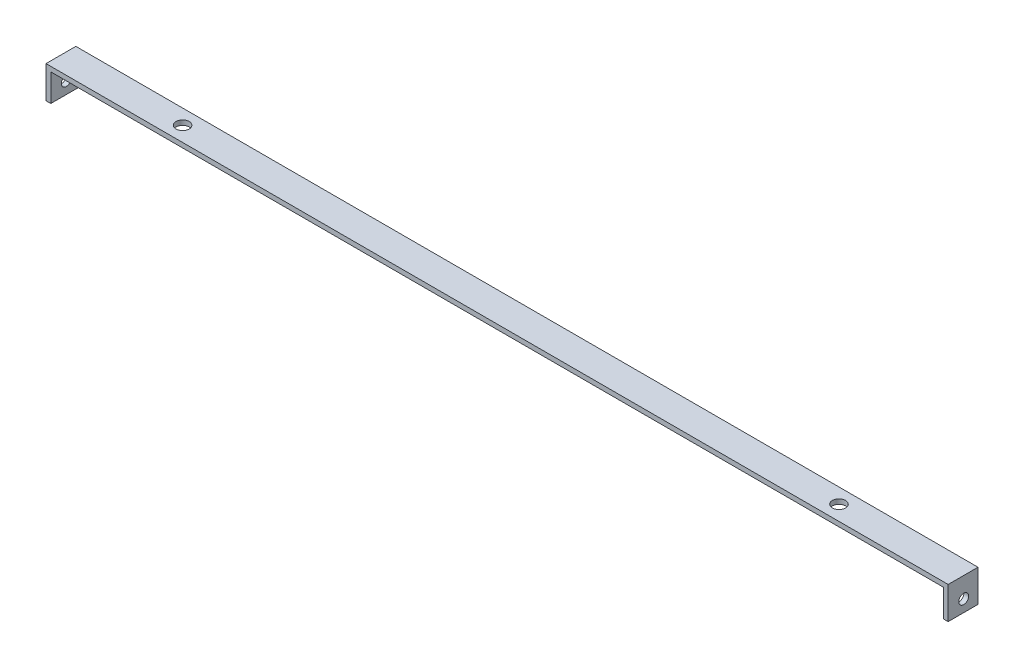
ISO-10303-21;
HEADER;
FILE_DESCRIPTION(('STEP AP214'),'2;1');
FILE_NAME('part.step','',(''),(''),'','','');
FILE_SCHEMA(('AUTOMOTIVE_DESIGN { 1 0 10303 214 1 1 1 1 }'));
ENDSEC;
DATA;
#1=APPLICATION_CONTEXT('core data for automotive mechanical design processes');
#2=APPLICATION_PROTOCOL_DEFINITION('international standard','automotive_design',2000,#1);
#3=PRODUCT_CONTEXT('',#1,'mechanical');
#4=PRODUCT('Part','Part','',(#3));
#5=PRODUCT_RELATED_PRODUCT_CATEGORY('part','',(#4));
#6=PRODUCT_DEFINITION_FORMATION('','',#4);
#7=PRODUCT_DEFINITION_CONTEXT('part definition',#1,'design');
#8=PRODUCT_DEFINITION('design','',#6,#7);
#9=PRODUCT_DEFINITION_SHAPE('','',#8);
#10=(LENGTH_UNIT() NAMED_UNIT(*) SI_UNIT(.MILLI.,.METRE.));
#11=(NAMED_UNIT(*) PLANE_ANGLE_UNIT() SI_UNIT($,.RADIAN.));
#12=(NAMED_UNIT(*) SI_UNIT($,.STERADIAN.) SOLID_ANGLE_UNIT());
#13=UNCERTAINTY_MEASURE_WITH_UNIT(LENGTH_MEASURE(1.E-05),#10,'distance_accuracy_value','');
#14=(GEOMETRIC_REPRESENTATION_CONTEXT(3) GLOBAL_UNCERTAINTY_ASSIGNED_CONTEXT((#13)) GLOBAL_UNIT_ASSIGNED_CONTEXT((#10,
#11,#12)) REPRESENTATION_CONTEXT('',''));
#15=CARTESIAN_POINT('',(0.,0.,0.));
#16=DIRECTION('',(0.,0.,1.));
#17=DIRECTION('',(1.,0.,0.));
#18=AXIS2_PLACEMENT_3D('',#15,#16,#17);
#19=CARTESIAN_POINT('',(-73.9140700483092,-27.,25.));
#20=DIRECTION('',(0.,1.,0.));
#21=DIRECTION('',(0.,0.,1.));
#22=AXIS2_PLACEMENT_3D('',#19,#20,#21);
#23=PLANE('',#22);
#24=DIRECTION('',(1.,0.,0.));
#25=VECTOR('',#24,1.);
#26=CARTESIAN_POINT('',(-73.9140700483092,-27.,0.));
#27=LINE('',#26,#25);
#28=CARTESIAN_POINT('',(-73.9140700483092,-27.,0.));
#29=VERTEX_POINT('',#28);
#30=CARTESIAN_POINT('',(-69.9140700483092,-27.,0.));
#31=VERTEX_POINT('',#30);
#32=EDGE_CURVE('E95',#29,#31,#27,.T.);
#33=ORIENTED_EDGE('',*,*,#32,.T.);
#34=DIRECTION('',(0.,0.,-1.));
#35=VECTOR('',#34,1.);
#36=CARTESIAN_POINT('',(-69.9140700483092,-27.,25.));
#37=LINE('',#36,#35);
#38=CARTESIAN_POINT('',(-69.9140700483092,-27.,25.));
#39=VERTEX_POINT('',#38);
#40=EDGE_CURVE('E11',#39,#31,#37,.T.);
#41=ORIENTED_EDGE('',*,*,#40,.F.);
#42=DIRECTION('',(1.,0.,0.));
#43=VECTOR('',#42,1.);
#44=CARTESIAN_POINT('',(-73.9140700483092,-27.,25.));
#45=LINE('',#44,#43);
#46=CARTESIAN_POINT('',(-73.9140700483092,-27.,25.));
#47=VERTEX_POINT('',#46);
#48=EDGE_CURVE('E127',#47,#39,#45,.T.);
#49=ORIENTED_EDGE('',*,*,#48,.F.);
#50=DIRECTION('',(0.,0.,-1.));
#51=VECTOR('',#50,1.);
#52=CARTESIAN_POINT('',(-73.9140700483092,-27.,25.));
#53=LINE('',#52,#51);
#54=EDGE_CURVE('E108',#47,#29,#53,.T.);
#55=ORIENTED_EDGE('',*,*,#54,.T.);
#56=EDGE_LOOP('',(#33,#41,#49,#55));
#57=FACE_BOUND('',#56,.T.);
#58=ADVANCED_FACE('F27',(#57),#23,.F.);
#59=CARTESIAN_POINT('',(-69.9140700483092,-27.,25.));
#60=DIRECTION('',(-1.,0.,0.));
#61=DIRECTION('',(0.,0.,1.));
#62=AXIS2_PLACEMENT_3D('',#59,#60,#61);
#63=PLANE('',#62);
#64=CARTESIAN_POINT('',(-69.9140700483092,-17.,12.));
#65=DIRECTION('',(-1.,0.,0.));
#66=DIRECTION('',(0.,0.,1.));
#67=AXIS2_PLACEMENT_3D('',#64,#65,#66);
#68=CIRCLE('',#67,4.13797110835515);
#69=CARTESIAN_POINT('',(-69.9140700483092,-17.,16.1379711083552));
#70=VERTEX_POINT('',#69);
#71=EDGE_CURVE('E224',#70,#70,#68,.T.);
#72=ORIENTED_EDGE('',*,*,#71,.T.);
#73=EDGE_LOOP('',(#72));
#74=FACE_BOUND('',#73,.T.);
#75=DIRECTION('',(0.,1.,0.));
#76=VECTOR('',#75,1.);
#77=CARTESIAN_POINT('',(-69.9140700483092,-27.,0.));
#78=LINE('',#77,#76);
#79=CARTESIAN_POINT('',(-69.9140700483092,-4.,0.));
#80=VERTEX_POINT('',#79);
#81=EDGE_CURVE('E91',#31,#80,#78,.T.);
#82=ORIENTED_EDGE('',*,*,#81,.T.);
#83=DIRECTION('',(0.,0.,-1.));
#84=VECTOR('',#83,1.);
#85=CARTESIAN_POINT('',(-69.9140700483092,-4.,25.));
#86=LINE('',#85,#84);
#87=CARTESIAN_POINT('',(-69.9140700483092,-4.,25.));
#88=VERTEX_POINT('',#87);
#89=EDGE_CURVE('E34',#88,#80,#86,.T.);
#90=ORIENTED_EDGE('',*,*,#89,.F.);
#91=DIRECTION('',(0.,1.,0.));
#92=VECTOR('',#91,1.);
#93=CARTESIAN_POINT('',(-69.9140700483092,-27.,25.));
#94=LINE('',#93,#92);
#95=EDGE_CURVE('E104',#39,#88,#94,.T.);
#96=ORIENTED_EDGE('',*,*,#95,.F.);
#97=ORIENTED_EDGE('',*,*,#40,.T.);
#98=EDGE_LOOP('',(#82,#90,#96,#97));
#99=FACE_BOUND('',#98,.T.);
#100=ADVANCED_FACE('F103',(#74,#99),#63,.F.);
#101=CARTESIAN_POINT('',(-69.9140700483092,-4.,25.));
#102=DIRECTION('',(0.,1.,0.));
#103=DIRECTION('',(0.,0.,1.));
#104=AXIS2_PLACEMENT_3D('',#101,#102,#103);
#105=PLANE('',#104);
#106=CARTESIAN_POINT('',(28.0859299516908,-4.,12.5));
#107=DIRECTION('',(0.,1.,0.));
#108=DIRECTION('',(0.,0.,1.));
#109=AXIS2_PLACEMENT_3D('',#106,#107,#108);
#110=CIRCLE('',#109,5.5);
#111=CARTESIAN_POINT('',(28.0859299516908,-4.,18.));
#112=VERTEX_POINT('',#111);
#113=EDGE_CURVE('E229',#112,#112,#110,.T.);
#114=ORIENTED_EDGE('',*,*,#113,.T.);
#115=EDGE_LOOP('',(#114));
#116=FACE_BOUND('',#115,.T.);
#117=CARTESIAN_POINT('',(578.085929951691,-4.,12.5));
#118=DIRECTION('',(0.,1.,0.));
#119=DIRECTION('',(0.,0.,1.));
#120=AXIS2_PLACEMENT_3D('',#117,#118,#119);
#121=CIRCLE('',#120,5.49999999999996);
#122=CARTESIAN_POINT('',(578.085929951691,-4.,18.));
#123=VERTEX_POINT('',#122);
#124=EDGE_CURVE('E109',#123,#123,#121,.T.);
#125=ORIENTED_EDGE('',*,*,#124,.T.);
#126=EDGE_LOOP('',(#125));
#127=FACE_BOUND('',#126,.T.);
#128=DIRECTION('',(1.,0.,0.));
#129=VECTOR('',#128,1.);
#130=CARTESIAN_POINT('',(-69.9140700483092,-4.,0.));
#131=LINE('',#130,#129);
#132=CARTESIAN_POINT('',(678.085929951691,-4.,0.));
#133=VERTEX_POINT('',#132);
#134=EDGE_CURVE('E97',#80,#133,#131,.T.);
#135=ORIENTED_EDGE('',*,*,#134,.T.);
#136=DIRECTION('',(0.,0.,-1.));
#137=VECTOR('',#136,1.);
#138=CARTESIAN_POINT('',(678.085929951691,-4.,25.));
#139=LINE('',#138,#137);
#140=CARTESIAN_POINT('',(678.085929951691,-4.,25.));
#141=VERTEX_POINT('',#140);
#142=EDGE_CURVE('E153',#141,#133,#139,.T.);
#143=ORIENTED_EDGE('',*,*,#142,.F.);
#144=DIRECTION('',(1.,0.,0.));
#145=VECTOR('',#144,1.);
#146=CARTESIAN_POINT('',(-69.9140700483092,-4.,25.));
#147=LINE('',#146,#145);
#148=EDGE_CURVE('E130',#88,#141,#147,.T.);
#149=ORIENTED_EDGE('',*,*,#148,.F.);
#150=ORIENTED_EDGE('',*,*,#89,.T.);
#151=EDGE_LOOP('',(#135,#143,#149,#150));
#152=FACE_BOUND('',#151,.T.);
#153=ADVANCED_FACE('F157',(#116,#127,#152),#105,.F.);
#154=CARTESIAN_POINT('',(678.085929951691,-4.,25.));
#155=DIRECTION('',(1.,0.,0.));
#156=DIRECTION('',(0.,0.,-1.));
#157=AXIS2_PLACEMENT_3D('',#154,#155,#156);
#158=PLANE('',#157);
#159=CARTESIAN_POINT('',(678.085929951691,-17.,12.));
#160=DIRECTION('',(1.,0.,0.));
#161=DIRECTION('',(0.,0.,-1.));
#162=AXIS2_PLACEMENT_3D('',#159,#160,#161);
#163=CIRCLE('',#162,4.13797110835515);
#164=CARTESIAN_POINT('',(678.085929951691,-17.,7.86202889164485));
#165=VERTEX_POINT('',#164);
#166=EDGE_CURVE('E219',#165,#165,#163,.T.);
#167=ORIENTED_EDGE('',*,*,#166,.T.);
#168=EDGE_LOOP('',(#167));
#169=FACE_BOUND('',#168,.T.);
#170=DIRECTION('',(0.,-1.,0.));
#171=VECTOR('',#170,1.);
#172=CARTESIAN_POINT('',(678.085929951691,-4.,0.));
#173=LINE('',#172,#171);
#174=CARTESIAN_POINT('',(678.085929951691,-27.,0.));
#175=VERTEX_POINT('',#174);
#176=EDGE_CURVE('E117',#133,#175,#173,.T.);
#177=ORIENTED_EDGE('',*,*,#176,.T.);
#178=DIRECTION('',(0.,0.,-1.));
#179=VECTOR('',#178,1.);
#180=CARTESIAN_POINT('',(678.085929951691,-27.,25.));
#181=LINE('',#180,#179);
#182=CARTESIAN_POINT('',(678.085929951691,-27.,25.));
#183=VERTEX_POINT('',#182);
#184=EDGE_CURVE('E150',#183,#175,#181,.T.);
#185=ORIENTED_EDGE('',*,*,#184,.F.);
#186=DIRECTION('',(0.,-1.,0.));
#187=VECTOR('',#186,1.);
#188=CARTESIAN_POINT('',(678.085929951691,-4.,25.));
#189=LINE('',#188,#187);
#190=EDGE_CURVE('E132',#141,#183,#189,.T.);
#191=ORIENTED_EDGE('',*,*,#190,.F.);
#192=ORIENTED_EDGE('',*,*,#142,.T.);
#193=EDGE_LOOP('',(#177,#185,#191,#192));
#194=FACE_BOUND('',#193,.T.);
#195=ADVANCED_FACE('F165',(#169,#194),#158,.F.);
#196=CARTESIAN_POINT('',(678.085929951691,-27.,25.));
#197=DIRECTION('',(0.,1.,0.));
#198=DIRECTION('',(0.,0.,1.));
#199=AXIS2_PLACEMENT_3D('',#196,#197,#198);
#200=PLANE('',#199);
#201=DIRECTION('',(1.,0.,0.));
#202=VECTOR('',#201,1.);
#203=CARTESIAN_POINT('',(678.085929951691,-27.,0.));
#204=LINE('',#203,#202);
#205=CARTESIAN_POINT('',(682.085929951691,-27.,0.));
#206=VERTEX_POINT('',#205);
#207=EDGE_CURVE('E119',#175,#206,#204,.T.);
#208=ORIENTED_EDGE('',*,*,#207,.T.);
#209=DIRECTION('',(0.,0.,-1.));
#210=VECTOR('',#209,1.);
#211=CARTESIAN_POINT('',(682.085929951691,-27.,25.));
#212=LINE('',#211,#210);
#213=CARTESIAN_POINT('',(682.085929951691,-27.,25.));
#214=VERTEX_POINT('',#213);
#215=EDGE_CURVE('E147',#214,#206,#212,.T.);
#216=ORIENTED_EDGE('',*,*,#215,.F.);
#217=DIRECTION('',(1.,0.,0.));
#218=VECTOR('',#217,1.);
#219=CARTESIAN_POINT('',(678.085929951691,-27.,25.));
#220=LINE('',#219,#218);
#221=EDGE_CURVE('E134',#183,#214,#220,.T.);
#222=ORIENTED_EDGE('',*,*,#221,.F.);
#223=ORIENTED_EDGE('',*,*,#184,.T.);
#224=EDGE_LOOP('',(#208,#216,#222,#223));
#225=FACE_BOUND('',#224,.T.);
#226=ADVANCED_FACE('F168',(#225),#200,.F.);
#227=CARTESIAN_POINT('',(682.085929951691,0.,25.));
#228=DIRECTION('',(-1.,0.,0.));
#229=DIRECTION('',(0.,0.,1.));
#230=AXIS2_PLACEMENT_3D('',#227,#228,#229);
#231=PLANE('',#230);
#232=CARTESIAN_POINT('',(682.085929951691,-17.,12.));
#233=DIRECTION('',(1.,0.,0.));
#234=DIRECTION('',(0.,0.,-1.));
#235=AXIS2_PLACEMENT_3D('',#232,#233,#234);
#236=CIRCLE('',#235,4.13797110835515);
#237=CARTESIAN_POINT('',(682.085929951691,-17.,7.86202889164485));
#238=VERTEX_POINT('',#237);
#239=EDGE_CURVE('E215',#238,#238,#236,.T.);
#240=ORIENTED_EDGE('',*,*,#239,.F.);
#241=EDGE_LOOP('',(#240));
#242=FACE_BOUND('',#241,.T.);
#243=DIRECTION('',(0.,1.,0.));
#244=VECTOR('',#243,1.);
#245=CARTESIAN_POINT('',(682.085929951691,0.,0.));
#246=LINE('',#245,#244);
#247=CARTESIAN_POINT('',(682.085929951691,0.,0.));
#248=VERTEX_POINT('',#247);
#249=EDGE_CURVE('E121',#206,#248,#246,.T.);
#250=ORIENTED_EDGE('',*,*,#249,.T.);
#251=DIRECTION('',(0.,0.,-1.));
#252=VECTOR('',#251,1.);
#253=CARTESIAN_POINT('',(682.085929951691,0.,25.));
#254=LINE('',#253,#252);
#255=CARTESIAN_POINT('',(682.085929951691,0.,25.));
#256=VERTEX_POINT('',#255);
#257=EDGE_CURVE('E144',#256,#248,#254,.T.);
#258=ORIENTED_EDGE('',*,*,#257,.F.);
#259=DIRECTION('',(0.,1.,0.));
#260=VECTOR('',#259,1.);
#261=CARTESIAN_POINT('',(682.085929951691,0.,25.));
#262=LINE('',#261,#260);
#263=EDGE_CURVE('E136',#214,#256,#262,.T.);
#264=ORIENTED_EDGE('',*,*,#263,.F.);
#265=ORIENTED_EDGE('',*,*,#215,.T.);
#266=EDGE_LOOP('',(#250,#258,#264,#265));
#267=FACE_BOUND('',#266,.T.);
#268=ADVANCED_FACE('F173',(#242,#267),#231,.F.);
#269=CARTESIAN_POINT('',(-73.9140700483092,0.,25.));
#270=DIRECTION('',(0.,-1.,0.));
#271=DIRECTION('',(0.,0.,-1.));
#272=AXIS2_PLACEMENT_3D('',#269,#270,#271);
#273=PLANE('',#272);
#274=CARTESIAN_POINT('',(28.0859299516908,0.,12.5));
#275=DIRECTION('',(0.,1.,0.));
#276=DIRECTION('',(0.,0.,1.));
#277=AXIS2_PLACEMENT_3D('',#274,#275,#276);
#278=CIRCLE('',#277,5.5);
#279=CARTESIAN_POINT('',(28.0859299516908,0.,18.));
#280=VERTEX_POINT('',#279);
#281=EDGE_CURVE('E226',#280,#280,#278,.T.);
#282=ORIENTED_EDGE('',*,*,#281,.F.);
#283=EDGE_LOOP('',(#282));
#284=FACE_BOUND('',#283,.T.);
#285=CARTESIAN_POINT('',(578.085929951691,0.,12.5));
#286=DIRECTION('',(0.,1.,0.));
#287=DIRECTION('',(0.,0.,1.));
#288=AXIS2_PLACEMENT_3D('',#285,#286,#287);
#289=CIRCLE('',#288,5.49999999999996);
#290=CARTESIAN_POINT('',(578.085929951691,0.,18.));
#291=VERTEX_POINT('',#290);
#292=EDGE_CURVE('E112',#291,#291,#289,.T.);
#293=ORIENTED_EDGE('',*,*,#292,.F.);
#294=EDGE_LOOP('',(#293));
#295=FACE_BOUND('',#294,.T.);
#296=DIRECTION('',(-1.,0.,0.));
#297=VECTOR('',#296,1.);
#298=CARTESIAN_POINT('',(-73.9140700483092,0.,0.));
#299=LINE('',#298,#297);
#300=CARTESIAN_POINT('',(-73.9140700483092,0.,0.));
#301=VERTEX_POINT('',#300);
#302=EDGE_CURVE('E123',#248,#301,#299,.T.);
#303=ORIENTED_EDGE('',*,*,#302,.T.);
#304=DIRECTION('',(0.,0.,-1.));
#305=VECTOR('',#304,1.);
#306=CARTESIAN_POINT('',(-73.9140700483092,0.,25.));
#307=LINE('',#306,#305);
#308=CARTESIAN_POINT('',(-73.9140700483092,0.,25.));
#309=VERTEX_POINT('',#308);
#310=EDGE_CURVE('E141',#309,#301,#307,.T.);
#311=ORIENTED_EDGE('',*,*,#310,.F.);
#312=DIRECTION('',(-1.,0.,0.));
#313=VECTOR('',#312,1.);
#314=CARTESIAN_POINT('',(-73.9140700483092,0.,25.));
#315=LINE('',#314,#313);
#316=EDGE_CURVE('E46',#256,#309,#315,.T.);
#317=ORIENTED_EDGE('',*,*,#316,.F.);
#318=ORIENTED_EDGE('',*,*,#257,.T.);
#319=EDGE_LOOP('',(#303,#311,#317,#318));
#320=FACE_BOUND('',#319,.T.);
#321=ADVANCED_FACE('F176',(#284,#295,#320),#273,.F.);
#322=CARTESIAN_POINT('',(-73.9140700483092,-27.,25.));
#323=DIRECTION('',(1.,0.,0.));
#324=DIRECTION('',(0.,0.,-1.));
#325=AXIS2_PLACEMENT_3D('',#322,#323,#324);
#326=PLANE('',#325);
#327=CARTESIAN_POINT('',(-73.9140700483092,-17.,12.));
#328=DIRECTION('',(1.,0.,0.));
#329=DIRECTION('',(0.,0.,-1.));
#330=AXIS2_PLACEMENT_3D('',#327,#328,#329);
#331=CIRCLE('',#330,4.13797110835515);
#332=CARTESIAN_POINT('',(-73.9140700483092,-17.,7.86202889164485));
#333=VERTEX_POINT('',#332);
#334=EDGE_CURVE('E217',#333,#333,#331,.T.);
#335=ORIENTED_EDGE('',*,*,#334,.T.);
#336=EDGE_LOOP('',(#335));
#337=FACE_BOUND('',#336,.T.);
#338=DIRECTION('',(0.,-1.,0.));
#339=VECTOR('',#338,1.);
#340=CARTESIAN_POINT('',(-73.9140700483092,-27.,0.));
#341=LINE('',#340,#339);
#342=EDGE_CURVE('E125',#301,#29,#341,.T.);
#343=ORIENTED_EDGE('',*,*,#342,.T.);
#344=ORIENTED_EDGE('',*,*,#54,.F.);
#345=DIRECTION('',(0.,-1.,0.));
#346=VECTOR('',#345,1.);
#347=CARTESIAN_POINT('',(-73.9140700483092,-27.,25.));
#348=LINE('',#347,#346);
#349=EDGE_CURVE('E41',#309,#47,#348,.T.);
#350=ORIENTED_EDGE('',*,*,#349,.F.);
#351=ORIENTED_EDGE('',*,*,#310,.T.);
#352=EDGE_LOOP('',(#343,#344,#350,#351));
#353=FACE_BOUND('',#352,.T.);
#354=ADVANCED_FACE('F178',(#337,#353),#326,.F.);
#355=CARTESIAN_POINT('',(-69.9140700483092,-27.,25.));
#356=DIRECTION('',(0.,0.,1.));
#357=DIRECTION('',(1.,0.,0.));
#358=AXIS2_PLACEMENT_3D('',#355,#356,#357);
#359=PLANE('',#358);
#360=ORIENTED_EDGE('',*,*,#48,.T.);
#361=ORIENTED_EDGE('',*,*,#95,.T.);
#362=ORIENTED_EDGE('',*,*,#148,.T.);
#363=ORIENTED_EDGE('',*,*,#190,.T.);
#364=ORIENTED_EDGE('',*,*,#221,.T.);
#365=ORIENTED_EDGE('',*,*,#263,.T.);
#366=ORIENTED_EDGE('',*,*,#316,.T.);
#367=ORIENTED_EDGE('',*,*,#349,.T.);
#368=EDGE_LOOP('',(#360,#361,#362,#363,#364,#365,#366,#367));
#369=FACE_BOUND('',#368,.T.);
#370=ADVANCED_FACE('F160',(#369),#359,.T.);
#371=CARTESIAN_POINT('',(-69.9140700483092,-27.,0.));
#372=DIRECTION('',(0.,0.,1.));
#373=DIRECTION('',(1.,0.,0.));
#374=AXIS2_PLACEMENT_3D('',#371,#372,#373);
#375=PLANE('',#374);
#376=ORIENTED_EDGE('',*,*,#32,.F.);
#377=ORIENTED_EDGE('',*,*,#342,.F.);
#378=ORIENTED_EDGE('',*,*,#302,.F.);
#379=ORIENTED_EDGE('',*,*,#249,.F.);
#380=ORIENTED_EDGE('',*,*,#207,.F.);
#381=ORIENTED_EDGE('',*,*,#176,.F.);
#382=ORIENTED_EDGE('',*,*,#134,.F.);
#383=ORIENTED_EDGE('',*,*,#81,.F.);
#384=EDGE_LOOP('',(#376,#377,#378,#379,#380,#381,#382,#383));
#385=FACE_BOUND('',#384,.T.);
#386=ADVANCED_FACE('F92',(#385),#375,.F.);
#387=CARTESIAN_POINT('',(578.085929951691,-25.,12.5));
#388=DIRECTION('',(0.,1.,0.));
#389=DIRECTION('',(0.,0.,1.));
#390=AXIS2_PLACEMENT_3D('',#387,#388,#389);
#391=CYLINDRICAL_SURFACE('',#390,5.49999999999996);
#392=ORIENTED_EDGE('',*,*,#292,.T.);
#393=EDGE_LOOP('',(#392));
#394=FACE_BOUND('',#393,.T.);
#395=ORIENTED_EDGE('',*,*,#124,.F.);
#396=EDGE_LOOP('',(#395));
#397=FACE_BOUND('',#396,.T.);
#398=ADVANCED_FACE('F234',(#394,#397),#391,.F.);
#399=CARTESIAN_POINT('',(28.0859299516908,-25.,12.5));
#400=DIRECTION('',(0.,1.,0.));
#401=DIRECTION('',(0.,0.,1.));
#402=AXIS2_PLACEMENT_3D('',#399,#400,#401);
#403=CYLINDRICAL_SURFACE('',#402,5.5);
#404=ORIENTED_EDGE('',*,*,#281,.T.);
#405=EDGE_LOOP('',(#404));
#406=FACE_BOUND('',#405,.T.);
#407=ORIENTED_EDGE('',*,*,#113,.F.);
#408=EDGE_LOOP('',(#407));
#409=FACE_BOUND('',#408,.T.);
#410=ADVANCED_FACE('F238',(#406,#409),#403,.F.);
#411=CARTESIAN_POINT('',(-73.9140700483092,-17.,12.));
#412=DIRECTION('',(1.,0.,0.));
#413=DIRECTION('',(0.,0.,-1.));
#414=AXIS2_PLACEMENT_3D('',#411,#412,#413);
#415=CYLINDRICAL_SURFACE('',#414,4.13797110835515);
#416=ORIENTED_EDGE('',*,*,#334,.F.);
#417=EDGE_LOOP('',(#416));
#418=FACE_BOUND('',#417,.T.);
#419=ORIENTED_EDGE('',*,*,#71,.F.);
#420=EDGE_LOOP('',(#419));
#421=FACE_BOUND('',#420,.T.);
#422=ADVANCED_FACE('F244',(#418,#421),#415,.F.);
#423=ORIENTED_EDGE('',*,*,#239,.T.);
#424=EDGE_LOOP('',(#423));
#425=FACE_BOUND('',#424,.T.);
#426=ORIENTED_EDGE('',*,*,#166,.F.);
#427=EDGE_LOOP('',(#426));
#428=FACE_BOUND('',#427,.T.);
#429=ADVANCED_FACE('F250',(#425,#428),#415,.F.);
#430=CLOSED_SHELL('',(#58,#100,#153,#195,#226,#268,#321,#354,#370,#386,#398,#410,#422,#429));
#431=MANIFOLD_SOLID_BREP('B2',#430);
#432=ADVANCED_BREP_SHAPE_REPRESENTATION('',(#18,#431),#14);
#433=SHAPE_DEFINITION_REPRESENTATION(#9,#432);
ENDSEC;
END-ISO-10303-21;
